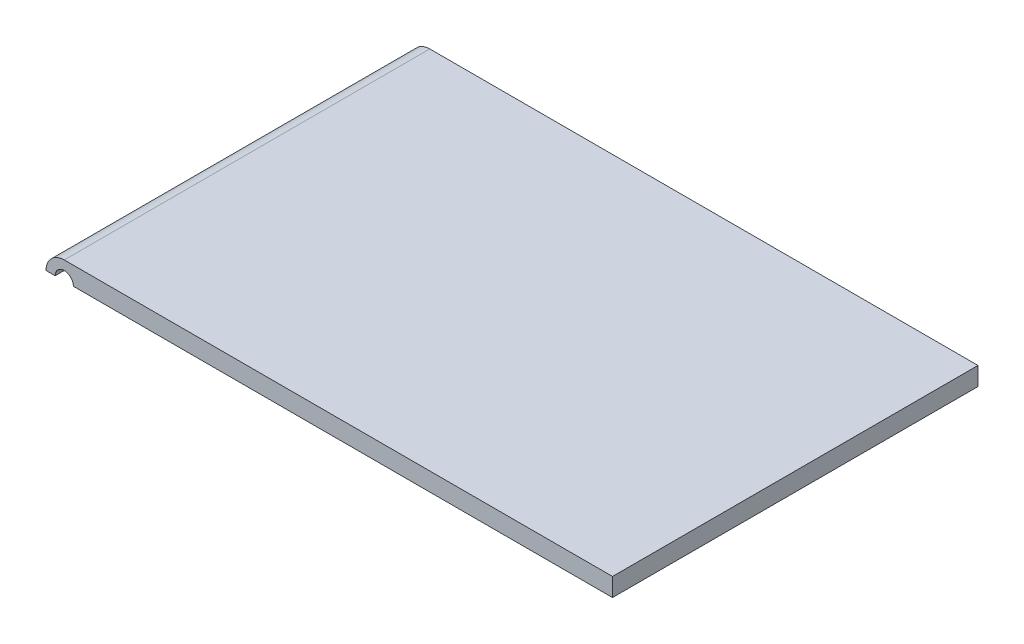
from build123d import *

# Parameters (mm, degrees)
ESQUISSE1_W             = 150
ESQUISSE1_H             = 5
BOSS_EXTRU_1_DEPTH      = 50
BOSS_EXTRU_2_DEPTH      = 100
ESQUISSE3_R             = 2.5
ENL_V_MAT_EXTRU_1_DEPTH = 181.346887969


with BuildPart() as part:
    # Esquisse1 → Boss.-Extru.1 (new, symmetric)
    with BuildSketch(Plane.XY):
        with Locations((75, -2.5)):
            Rectangle(ESQUISSE1_W, ESQUISSE1_H)
    extrude(amount=BOSS_EXTRU_1_DEPTH, both=True)

    # Esquisse2 → Boss.-Extru.2 (add)
    with BuildSketch(Plane.XY.offset(50)):
        with BuildLine():
            Line((0, -5), (-5, -5))
            ThreePointArc((-5, -5), (-3.535533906, -1.464466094), (0, 0))
            Line((0, 0), (0, -5))
        make_face()
    extrude(amount=-BOSS_EXTRU_2_DEPTH)

    # Esquisse3 → Enl_v. mat.-Extru.1 (cut, through all)
    with BuildSketch(Plane.XY.offset(50)):
        with Locations((0, -5)):
            Circle(ESQUISSE3_R)
    extrude(amount=-ENL_V_MAT_EXTRU_1_DEPTH, mode=Mode.SUBTRACT)


solid = part.part
